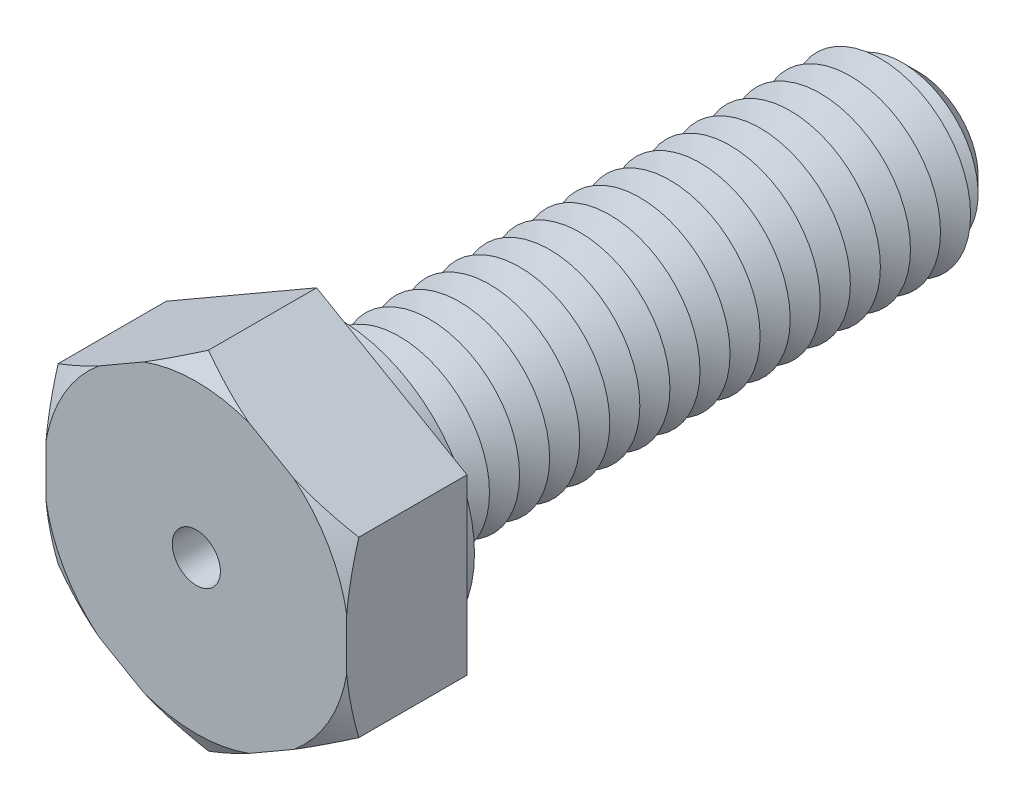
from build123d import *

# Parameters (mm, degrees)
BOSS_EXTRUDE1_DEPTH = 4
SKETCH3_R           = 3
BOSS_EXTRUDE2_DEPTH = 20
SKETCH4_R           = 4.5
BOSS_EXTRUDE3_DEPTH = 0.75
CHAMFER1_SIZE       = 1
LPATTERN1_COUNT     = 19
LPATTERN1_PITCH     = 1
SKETCH8_R           = 0.8
CUT_EXTRUDE1_DEPTH  = 24


with BuildPart() as part:
    # Sketch2 → Boss-Extrude1 (new body)
    with BuildSketch(Plane.XY):
        Polygon((0, 5.773502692), (-5, 2.886751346), (-5, -2.886751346), (0, -5.773502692), (5, -2.886751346), (5, 2.886751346), align=None)
    extrude(amount=BOSS_EXTRUDE1_DEPTH)

    # Sketch3 → Boss-Extrude2 (add)
    with BuildSketch(Plane(origin=(0, 0, 0), x_dir=(-1, 0, 0), z_dir=(0, 0, -1))):
        Circle(SKETCH3_R)
    extrude(amount=BOSS_EXTRUDE2_DEPTH)

    # Sketch4 → Boss-Extrude3 (add)
    with BuildSketch(Plane(origin=(0, 0, 0), x_dir=(-1, 0, 0), z_dir=(0, 0, -1))):
        with Locations(Location((0, 0, 0), (0, 0, 180))):
            Circle(SKETCH4_R)
    extrude(amount=BOSS_EXTRUDE3_DEPTH)

    # Chamfer1
    chamfer1_edges = [part.edges().sort_by_distance(p)[0] for p in [
        (3, 0, -20),
    ]]
    chamfer(chamfer1_edges, length=CHAMFER1_SIZE)

    # Sketch6 → Cut-Revolve1 (revolve, cut)
    with BuildSketch(Plane(origin=(0, 0, 0), x_dir=(0, 0, -1), z_dir=(1, 0, 0)), mode=Mode.PRIVATE) as cut_revolve1_sk:
        Polygon((0.75, 3), (1.25, 2.133974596), (1.75, 3), align=None)
    cut_revolve1 = revolve(cut_revolve1_sk.sketch.rotate(Axis((0, 0, 3.211670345), (0, 0, -1)), 90), axis=Axis((0, 0, 3.211670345), (0, 0, -1)), mode=Mode.SUBTRACT)

    # LPattern1: Cut-Revolve1 ×19
    with Locations(*[(0, 0, -i * LPATTERN1_PITCH) for i in range(1, LPATTERN1_COUNT)]):
        add(cut_revolve1, mode=Mode.SUBTRACT)

    # Sketch7 → Cut-Revolve2 (revolve, cut)
    with BuildSketch(Plane(origin=(0, 0, 0), x_dir=(0, 0, -1), z_dir=(1, 0, 0)), mode=Mode.PRIVATE) as cut_revolve2_sk:
        Polygon((-4, 5.773502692), (-4, 5.073502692), (-3.595854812, 5.773502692), align=None)
    revolve(cut_revolve2_sk.sketch.rotate(Axis((0, 0, 3.211670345), (0, 0, -1)), 270), axis=Axis((0, 0, 3.211670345), (0, 0, -1)), mode=Mode.SUBTRACT)

    # Sketch8 → Cut-Extrude1 (cut)
    with BuildSketch(Plane.XY.offset(4)):
        Circle(SKETCH8_R)
    extrude(amount=-CUT_EXTRUDE1_DEPTH, mode=Mode.SUBTRACT)


solid = part.part
